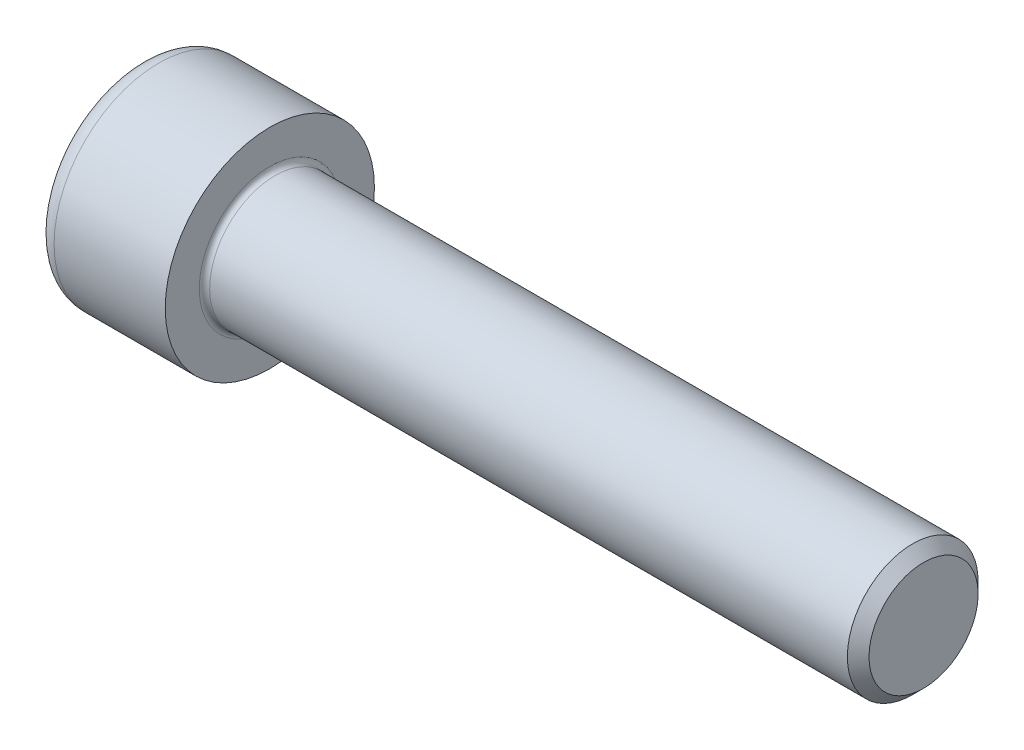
ISO-10303-21;
HEADER;
FILE_DESCRIPTION(('STEP AP214'),'2;1');
FILE_NAME('part.step','',(''),(''),'','','');
FILE_SCHEMA(('AUTOMOTIVE_DESIGN { 1 0 10303 214 1 1 1 1 }'));
ENDSEC;
DATA;
#1=APPLICATION_CONTEXT('core data for automotive mechanical design processes');
#2=APPLICATION_PROTOCOL_DEFINITION('international standard','automotive_design',2000,#1);
#3=PRODUCT_CONTEXT('',#1,'mechanical');
#4=PRODUCT('Part','Part','',(#3));
#5=PRODUCT_RELATED_PRODUCT_CATEGORY('part','',(#4));
#6=PRODUCT_DEFINITION_FORMATION('','',#4);
#7=PRODUCT_DEFINITION_CONTEXT('part definition',#1,'design');
#8=PRODUCT_DEFINITION('design','',#6,#7);
#9=PRODUCT_DEFINITION_SHAPE('','',#8);
#10=(LENGTH_UNIT() NAMED_UNIT(*) SI_UNIT(.MILLI.,.METRE.));
#11=(NAMED_UNIT(*) PLANE_ANGLE_UNIT() SI_UNIT($,.RADIAN.));
#12=(NAMED_UNIT(*) SI_UNIT($,.STERADIAN.) SOLID_ANGLE_UNIT());
#13=UNCERTAINTY_MEASURE_WITH_UNIT(LENGTH_MEASURE(1.E-05),#10,'distance_accuracy_value','');
#14=(GEOMETRIC_REPRESENTATION_CONTEXT(3) GLOBAL_UNCERTAINTY_ASSIGNED_CONTEXT((#13)) GLOBAL_UNIT_ASSIGNED_CONTEXT((#10,
#11,#12)) REPRESENTATION_CONTEXT('',''));
#15=CARTESIAN_POINT('',(0.,0.,0.));
#16=DIRECTION('',(0.,0.,1.));
#17=DIRECTION('',(1.,0.,0.));
#18=AXIS2_PLACEMENT_3D('',#15,#16,#17);
#19=CARTESIAN_POINT('',(0.,0.,0.));
#20=DIRECTION('',(-1.,0.,0.));
#21=DIRECTION('',(0.,0.,1.));
#22=AXIS2_PLACEMENT_3D('',#19,#20,#21);
#23=PLANE('',#22);
#24=DIRECTION('',(0.,-0.499999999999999,0.866025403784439));
#25=VECTOR('',#24,1.);
#26=CARTESIAN_POINT('',(0.,4.68519743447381,0.));
#27=LINE('',#26,#25);
#28=CARTESIAN_POINT('',(0.,4.68519743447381,0.));
#29=VERTEX_POINT('',#28);
#30=CARTESIAN_POINT('',(0.,2.34259871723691,4.0575));
#31=VERTEX_POINT('',#30);
#32=EDGE_CURVE('E257',#29,#31,#27,.T.);
#33=ORIENTED_EDGE('',*,*,#32,.T.);
#34=DIRECTION('',(0.,1.,0.));
#35=VECTOR('',#34,1.);
#36=CARTESIAN_POINT('',(0.,-2.34259871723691,4.0575));
#37=LINE('',#36,#35);
#38=CARTESIAN_POINT('',(0.,-2.34259871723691,4.0575));
#39=VERTEX_POINT('',#38);
#40=EDGE_CURVE('E129',#39,#31,#37,.T.);
#41=ORIENTED_EDGE('',*,*,#40,.F.);
#42=DIRECTION('',(0.,-0.500000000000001,-0.866025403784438));
#43=VECTOR('',#42,1.);
#44=CARTESIAN_POINT('',(0.,-2.34259871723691,4.0575));
#45=LINE('',#44,#43);
#46=CARTESIAN_POINT('',(0.,-4.68519743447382,0.));
#47=VERTEX_POINT('',#46);
#48=EDGE_CURVE('E260',#39,#47,#45,.T.);
#49=ORIENTED_EDGE('',*,*,#48,.T.);
#50=DIRECTION('',(0.,0.499999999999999,-0.866025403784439));
#51=VECTOR('',#50,1.);
#52=CARTESIAN_POINT('',(0.,-4.68519743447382,0.));
#53=LINE('',#52,#51);
#54=CARTESIAN_POINT('',(0.,-2.34259871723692,-4.0575));
#55=VERTEX_POINT('',#54);
#56=EDGE_CURVE('E263',#47,#55,#53,.T.);
#57=ORIENTED_EDGE('',*,*,#56,.T.);
#58=DIRECTION('',(0.,-1.,0.));
#59=VECTOR('',#58,1.);
#60=CARTESIAN_POINT('',(0.,2.3425987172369,-4.0575));
#61=LINE('',#60,#59);
#62=CARTESIAN_POINT('',(0.,2.3425987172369,-4.0575));
#63=VERTEX_POINT('',#62);
#64=EDGE_CURVE('E266',#63,#55,#61,.T.);
#65=ORIENTED_EDGE('',*,*,#64,.F.);
#66=DIRECTION('',(0.,-0.500000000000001,-0.866025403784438));
#67=VECTOR('',#66,1.);
#68=CARTESIAN_POINT('',(0.,4.68519743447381,0.));
#69=LINE('',#68,#67);
#70=EDGE_CURVE('E124',#29,#63,#69,.T.);
#71=ORIENTED_EDGE('',*,*,#70,.F.);
#72=EDGE_LOOP('',(#33,#41,#49,#57,#65,#71));
#73=FACE_BOUND('',#72,.T.);
#74=CARTESIAN_POINT('',(0.,0.,0.));
#75=DIRECTION('',(-1.,0.,0.));
#76=DIRECTION('',(0.,0.,1.));
#77=AXIS2_PLACEMENT_3D('',#74,#75,#76);
#78=CIRCLE('',#77,6.5);
#79=CARTESIAN_POINT('',(0.,0.,6.5));
#80=VERTEX_POINT('',#79);
#81=EDGE_CURVE('E41',#80,#80,#78,.T.);
#82=ORIENTED_EDGE('',*,*,#81,.T.);
#83=EDGE_LOOP('',(#82));
#84=FACE_BOUND('',#83,.T.);
#85=ADVANCED_FACE('F33',(#73,#84),#23,.T.);
#86=CARTESIAN_POINT('',(-31.75,0.,0.));
#87=DIRECTION('',(-1.,0.,0.));
#88=DIRECTION('',(0.,0.,1.));
#89=AXIS2_PLACEMENT_3D('',#86,#87,#88);
#90=CYLINDRICAL_SURFACE('',#89,8.);
#91=CARTESIAN_POINT('',(1.5,0.,0.));
#92=DIRECTION('',(-1.,0.,0.));
#93=DIRECTION('',(0.,0.,1.));
#94=AXIS2_PLACEMENT_3D('',#91,#92,#93);
#95=CIRCLE('',#94,8.);
#96=CARTESIAN_POINT('',(1.5,0.,8.));
#97=VERTEX_POINT('',#96);
#98=EDGE_CURVE('E11',#97,#97,#95,.F.);
#99=ORIENTED_EDGE('',*,*,#98,.T.);
#100=EDGE_LOOP('',(#99));
#101=FACE_BOUND('',#100,.T.);
#102=CARTESIAN_POINT('',(10.,0.,0.));
#103=DIRECTION('',(-1.,0.,0.));
#104=DIRECTION('',(0.,0.,1.));
#105=AXIS2_PLACEMENT_3D('',#102,#103,#104);
#106=CIRCLE('',#105,8.);
#107=CARTESIAN_POINT('',(10.,0.,8.));
#108=VERTEX_POINT('',#107);
#109=EDGE_CURVE('E147',#108,#108,#106,.T.);
#110=ORIENTED_EDGE('',*,*,#109,.T.);
#111=EDGE_LOOP('',(#110));
#112=FACE_BOUND('',#111,.T.);
#113=ADVANCED_FACE('F171',(#101,#112),#90,.T.);
#114=CARTESIAN_POINT('',(10.,8.,0.));
#115=DIRECTION('',(1.,0.,0.));
#116=DIRECTION('',(0.,0.,-1.));
#117=AXIS2_PLACEMENT_3D('',#114,#115,#116);
#118=PLANE('',#117);
#119=CARTESIAN_POINT('',(10.,0.,0.));
#120=DIRECTION('',(1.,0.,0.));
#121=DIRECTION('',(0.,0.,-1.));
#122=AXIS2_PLACEMENT_3D('',#119,#120,#121);
#123=CIRCLE('',#122,5.39999999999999);
#124=CARTESIAN_POINT('',(10.,0.,-5.39999999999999));
#125=VERTEX_POINT('',#124);
#126=EDGE_CURVE('E150',#125,#125,#123,.F.);
#127=ORIENTED_EDGE('',*,*,#126,.T.);
#128=EDGE_LOOP('',(#127));
#129=FACE_BOUND('',#128,.T.);
#130=ORIENTED_EDGE('',*,*,#109,.F.);
#131=EDGE_LOOP('',(#130));
#132=FACE_BOUND('',#131,.T.);
#133=ADVANCED_FACE('F177',(#129,#132),#118,.T.);
#134=CARTESIAN_POINT('',(-31.75,0.,0.));
#135=DIRECTION('',(-1.,0.,0.));
#136=DIRECTION('',(0.,0.,1.));
#137=AXIS2_PLACEMENT_3D('',#134,#135,#136);
#138=CYLINDRICAL_SURFACE('',#137,4.99999999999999);
#139=CARTESIAN_POINT('',(10.4,0.,0.));
#140=DIRECTION('',(1.,0.,0.));
#141=DIRECTION('',(0.,0.,-1.));
#142=AXIS2_PLACEMENT_3D('',#139,#140,#141);
#143=CIRCLE('',#142,4.99999999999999);
#144=CARTESIAN_POINT('',(10.4,0.,-4.99999999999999));
#145=VERTEX_POINT('',#144);
#146=EDGE_CURVE('E153',#145,#145,#143,.T.);
#147=ORIENTED_EDGE('',*,*,#146,.T.);
#148=EDGE_LOOP('',(#147));
#149=FACE_BOUND('',#148,.T.);
#150=CARTESIAN_POINT('',(59.172,0.,0.));
#151=DIRECTION('',(-1.,0.,0.));
#152=DIRECTION('',(0.,0.,1.));
#153=AXIS2_PLACEMENT_3D('',#150,#151,#152);
#154=CIRCLE('',#153,4.99999999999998);
#155=CARTESIAN_POINT('',(59.172,0.,4.99999999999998));
#156=VERTEX_POINT('',#155);
#157=EDGE_CURVE('E144',#156,#156,#154,.T.);
#158=ORIENTED_EDGE('',*,*,#157,.T.);
#159=EDGE_LOOP('',(#158));
#160=FACE_BOUND('',#159,.T.);
#161=ADVANCED_FACE('F183',(#149,#160),#138,.T.);
#162=CARTESIAN_POINT('',(60.,0.,0.));
#163=DIRECTION('',(-1.,0.,0.));
#164=DIRECTION('',(0.,0.,1.));
#165=AXIS2_PLACEMENT_3D('',#162,#163,#164);
#166=CONICAL_SURFACE('',#165,4.172,0.78539816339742);
#167=ORIENTED_EDGE('',*,*,#157,.F.);
#168=EDGE_LOOP('',(#167));
#169=FACE_BOUND('',#168,.T.);
#170=CARTESIAN_POINT('',(60.,0.,0.));
#171=DIRECTION('',(-1.,0.,0.));
#172=DIRECTION('',(0.,0.,1.));
#173=AXIS2_PLACEMENT_3D('',#170,#171,#172);
#174=CIRCLE('',#173,4.172);
#175=CARTESIAN_POINT('',(60.,0.,4.172));
#176=VERTEX_POINT('',#175);
#177=EDGE_CURVE('E140',#176,#176,#174,.T.);
#178=ORIENTED_EDGE('',*,*,#177,.T.);
#179=EDGE_LOOP('',(#178));
#180=FACE_BOUND('',#179,.T.);
#181=ADVANCED_FACE('F187',(#169,#180),#166,.T.);
#182=CARTESIAN_POINT('',(60.,4.172,0.));
#183=DIRECTION('',(1.,0.,0.));
#184=DIRECTION('',(0.,0.,-1.));
#185=AXIS2_PLACEMENT_3D('',#182,#183,#184);
#186=PLANE('',#185);
#187=ORIENTED_EDGE('',*,*,#177,.F.);
#188=EDGE_LOOP('',(#187));
#189=FACE_BOUND('',#188,.T.);
#190=ADVANCED_FACE('F167',(#189),#186,.T.);
#191=CARTESIAN_POINT('',(10.4,0.,0.));
#192=DIRECTION('',(1.,0.,0.));
#193=DIRECTION('',(0.,0.,-1.));
#194=AXIS2_PLACEMENT_3D('',#191,#192,#193);
#195=TOROIDAL_SURFACE('',#194,5.39999999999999,0.4);
#196=ORIENTED_EDGE('',*,*,#146,.F.);
#197=EDGE_LOOP('',(#196));
#198=FACE_BOUND('',#197,.T.);
#199=ORIENTED_EDGE('',*,*,#126,.F.);
#200=EDGE_LOOP('',(#199));
#201=FACE_BOUND('',#200,.T.);
#202=ADVANCED_FACE('F160',(#198,#201),#195,.F.);
#203=CARTESIAN_POINT('',(1.5,0.,0.));
#204=DIRECTION('',(-1.,0.,0.));
#205=DIRECTION('',(0.,0.,1.));
#206=AXIS2_PLACEMENT_3D('',#203,#204,#205);
#207=TOROIDAL_SURFACE('',#206,6.5,1.5);
#208=ORIENTED_EDGE('',*,*,#98,.F.);
#209=EDGE_LOOP('',(#208));
#210=FACE_BOUND('',#209,.T.);
#211=ORIENTED_EDGE('',*,*,#81,.F.);
#212=EDGE_LOOP('',(#211));
#213=FACE_BOUND('',#212,.T.);
#214=ADVANCED_FACE('F35',(#210,#213),#207,.T.);
#215=CARTESIAN_POINT('',(5.,4.68519743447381,0.));
#216=DIRECTION('',(0.,-0.866025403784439,-0.499999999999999));
#217=DIRECTION('',(0.,0.499999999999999,-0.866025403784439));
#218=AXIS2_PLACEMENT_3D('',#215,#216,#217);
#219=PLANE('',#218);
#220=ORIENTED_EDGE('',*,*,#32,.F.);
#221=DIRECTION('',(-1.,0.,0.));
#222=VECTOR('',#221,1.);
#223=CARTESIAN_POINT('',(5.,4.68519743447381,0.));
#224=LINE('',#223,#222);
#225=CARTESIAN_POINT('',(5.,4.68519743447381,0.));
#226=VERTEX_POINT('',#225);
#227=EDGE_CURVE('E247',#226,#29,#224,.T.);
#228=ORIENTED_EDGE('',*,*,#227,.F.);
#229=DIRECTION('',(0.,-0.499999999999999,0.866025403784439));
#230=VECTOR('',#229,1.);
#231=CARTESIAN_POINT('',(5.,4.68519743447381,0.));
#232=LINE('',#231,#230);
#233=CARTESIAN_POINT('',(5.,3.51389807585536,2.02874999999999));
#234=VERTEX_POINT('',#233);
#235=EDGE_CURVE('E116',#226,#234,#232,.T.);
#236=ORIENTED_EDGE('',*,*,#235,.T.);
#237=CARTESIAN_POINT('',(5.,2.34259871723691,4.0575));
#238=VERTEX_POINT('',#237);
#239=EDGE_CURVE('E107',#234,#238,#232,.T.);
#240=ORIENTED_EDGE('',*,*,#239,.T.);
#241=DIRECTION('',(-1.,0.,0.));
#242=VECTOR('',#241,1.);
#243=CARTESIAN_POINT('',(5.,2.34259871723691,4.0575));
#244=LINE('',#243,#242);
#245=EDGE_CURVE('E121',#238,#31,#244,.T.);
#246=ORIENTED_EDGE('',*,*,#245,.T.);
#247=EDGE_LOOP('',(#220,#228,#236,#240,#246));
#248=FACE_BOUND('',#247,.T.);
#249=ADVANCED_FACE('F120',(#248),#219,.T.);
#250=CARTESIAN_POINT('',(5.,-2.34259871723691,4.0575));
#251=DIRECTION('',(0.,0.,1.));
#252=DIRECTION('',(0.,-1.,0.));
#253=AXIS2_PLACEMENT_3D('',#250,#251,#252);
#254=PLANE('',#253);
#255=ORIENTED_EDGE('',*,*,#40,.T.);
#256=ORIENTED_EDGE('',*,*,#245,.F.);
#257=DIRECTION('',(0.,1.,0.));
#258=VECTOR('',#257,1.);
#259=CARTESIAN_POINT('',(5.,-2.34259871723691,4.0575));
#260=LINE('',#259,#258);
#261=CARTESIAN_POINT('',(5.,0.,4.0575));
#262=VERTEX_POINT('',#261);
#263=EDGE_CURVE('E104',#262,#238,#260,.T.);
#264=ORIENTED_EDGE('',*,*,#263,.F.);
#265=CARTESIAN_POINT('',(5.,-2.34259871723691,4.0575));
#266=VERTEX_POINT('',#265);
#267=EDGE_CURVE('E115',#266,#262,#260,.T.);
#268=ORIENTED_EDGE('',*,*,#267,.F.);
#269=DIRECTION('',(-1.,0.,0.));
#270=VECTOR('',#269,1.);
#271=CARTESIAN_POINT('',(5.,-2.34259871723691,4.0575));
#272=LINE('',#271,#270);
#273=EDGE_CURVE('E131',#266,#39,#272,.T.);
#274=ORIENTED_EDGE('',*,*,#273,.T.);
#275=EDGE_LOOP('',(#255,#256,#264,#268,#274));
#276=FACE_BOUND('',#275,.T.);
#277=ADVANCED_FACE('F126',(#276),#254,.F.);
#278=CARTESIAN_POINT('',(5.,-2.34259871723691,4.0575));
#279=DIRECTION('',(0.,0.866025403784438,-0.500000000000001));
#280=DIRECTION('',(0.,0.500000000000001,0.866025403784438));
#281=AXIS2_PLACEMENT_3D('',#278,#279,#280);
#282=PLANE('',#281);
#283=ORIENTED_EDGE('',*,*,#48,.F.);
#284=ORIENTED_EDGE('',*,*,#273,.F.);
#285=DIRECTION('',(0.,-0.500000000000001,-0.866025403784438));
#286=VECTOR('',#285,1.);
#287=CARTESIAN_POINT('',(5.,-2.34259871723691,4.0575));
#288=LINE('',#287,#286);
#289=CARTESIAN_POINT('',(5.,-3.51389807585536,2.02875000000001));
#290=VERTEX_POINT('',#289);
#291=EDGE_CURVE('E286',#266,#290,#288,.T.);
#292=ORIENTED_EDGE('',*,*,#291,.T.);
#293=CARTESIAN_POINT('',(5.,-4.68519743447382,0.));
#294=VERTEX_POINT('',#293);
#295=EDGE_CURVE('E275',#290,#294,#288,.T.);
#296=ORIENTED_EDGE('',*,*,#295,.T.);
#297=DIRECTION('',(-1.,0.,0.));
#298=VECTOR('',#297,1.);
#299=CARTESIAN_POINT('',(5.,-4.68519743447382,0.));
#300=LINE('',#299,#298);
#301=EDGE_CURVE('E136',#294,#47,#300,.T.);
#302=ORIENTED_EDGE('',*,*,#301,.T.);
#303=EDGE_LOOP('',(#283,#284,#292,#296,#302));
#304=FACE_BOUND('',#303,.T.);
#305=ADVANCED_FACE('F201',(#304),#282,.T.);
#306=CARTESIAN_POINT('',(5.,-4.68519743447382,0.));
#307=DIRECTION('',(0.,0.866025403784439,0.499999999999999));
#308=DIRECTION('',(0.,-0.499999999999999,0.866025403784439));
#309=AXIS2_PLACEMENT_3D('',#306,#307,#308);
#310=PLANE('',#309);
#311=ORIENTED_EDGE('',*,*,#56,.F.);
#312=ORIENTED_EDGE('',*,*,#301,.F.);
#313=DIRECTION('',(0.,0.499999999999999,-0.866025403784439));
#314=VECTOR('',#313,1.);
#315=CARTESIAN_POINT('',(5.,-4.68519743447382,0.));
#316=LINE('',#315,#314);
#317=CARTESIAN_POINT('',(5.,-3.51389807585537,-2.02875));
#318=VERTEX_POINT('',#317);
#319=EDGE_CURVE('E253',#294,#318,#316,.T.);
#320=ORIENTED_EDGE('',*,*,#319,.T.);
#321=CARTESIAN_POINT('',(5.,-2.34259871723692,-4.0575));
#322=VERTEX_POINT('',#321);
#323=EDGE_CURVE('E285',#318,#322,#316,.T.);
#324=ORIENTED_EDGE('',*,*,#323,.T.);
#325=DIRECTION('',(-1.,0.,0.));
#326=VECTOR('',#325,1.);
#327=CARTESIAN_POINT('',(5.,-2.34259871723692,-4.0575));
#328=LINE('',#327,#326);
#329=EDGE_CURVE('E246',#322,#55,#328,.T.);
#330=ORIENTED_EDGE('',*,*,#329,.T.);
#331=EDGE_LOOP('',(#311,#312,#320,#324,#330));
#332=FACE_BOUND('',#331,.T.);
#333=ADVANCED_FACE('F204',(#332),#310,.T.);
#334=CARTESIAN_POINT('',(5.,2.3425987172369,-4.0575));
#335=DIRECTION('',(0.,0.,-1.));
#336=DIRECTION('',(0.,1.,0.));
#337=AXIS2_PLACEMENT_3D('',#334,#335,#336);
#338=PLANE('',#337);
#339=ORIENTED_EDGE('',*,*,#64,.T.);
#340=ORIENTED_EDGE('',*,*,#329,.F.);
#341=DIRECTION('',(0.,-1.,0.));
#342=VECTOR('',#341,1.);
#343=CARTESIAN_POINT('',(5.,2.3425987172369,-4.0575));
#344=LINE('',#343,#342);
#345=CARTESIAN_POINT('',(5.,0.,-4.0575));
#346=VERTEX_POINT('',#345);
#347=EDGE_CURVE('E250',#346,#322,#344,.T.);
#348=ORIENTED_EDGE('',*,*,#347,.F.);
#349=CARTESIAN_POINT('',(5.,2.3425987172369,-4.0575));
#350=VERTEX_POINT('',#349);
#351=EDGE_CURVE('E48',#350,#346,#344,.T.);
#352=ORIENTED_EDGE('',*,*,#351,.F.);
#353=DIRECTION('',(-1.,0.,0.));
#354=VECTOR('',#353,1.);
#355=CARTESIAN_POINT('',(5.,2.3425987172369,-4.0575));
#356=LINE('',#355,#354);
#357=EDGE_CURVE('E243',#350,#63,#356,.T.);
#358=ORIENTED_EDGE('',*,*,#357,.T.);
#359=EDGE_LOOP('',(#339,#340,#348,#352,#358));
#360=FACE_BOUND('',#359,.T.);
#361=ADVANCED_FACE('F208',(#360),#338,.F.);
#362=CARTESIAN_POINT('',(5.,4.68519743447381,0.));
#363=DIRECTION('',(0.,0.866025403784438,-0.500000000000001));
#364=DIRECTION('',(0.,0.500000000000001,0.866025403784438));
#365=AXIS2_PLACEMENT_3D('',#362,#363,#364);
#366=PLANE('',#365);
#367=ORIENTED_EDGE('',*,*,#70,.T.);
#368=ORIENTED_EDGE('',*,*,#357,.F.);
#369=DIRECTION('',(0.,-0.500000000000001,-0.866025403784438));
#370=VECTOR('',#369,1.);
#371=CARTESIAN_POINT('',(5.,4.68519743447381,0.));
#372=LINE('',#371,#370);
#373=CARTESIAN_POINT('',(5.,3.51389807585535,-2.02875));
#374=VERTEX_POINT('',#373);
#375=EDGE_CURVE('E233',#374,#350,#372,.T.);
#376=ORIENTED_EDGE('',*,*,#375,.F.);
#377=EDGE_CURVE('E239',#226,#374,#372,.T.);
#378=ORIENTED_EDGE('',*,*,#377,.F.);
#379=ORIENTED_EDGE('',*,*,#227,.T.);
#380=EDGE_LOOP('',(#367,#368,#376,#378,#379));
#381=FACE_BOUND('',#380,.T.);
#382=ADVANCED_FACE('F212',(#381),#366,.F.);
#383=CARTESIAN_POINT('',(5.,4.68519743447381,0.));
#384=DIRECTION('',(1.,0.,0.));
#385=DIRECTION('',(0.,0.,-1.));
#386=AXIS2_PLACEMENT_3D('',#383,#384,#385);
#387=PLANE('',#386);
#388=ORIENTED_EDGE('',*,*,#347,.T.);
#389=ORIENTED_EDGE('',*,*,#323,.F.);
#390=CARTESIAN_POINT('',(5.,0.,0.));
#391=DIRECTION('',(-1.,0.,0.));
#392=DIRECTION('',(0.,0.,1.));
#393=AXIS2_PLACEMENT_3D('',#390,#391,#392);
#394=CIRCLE('',#393,4.0575);
#395=EDGE_CURVE('E281',#346,#318,#394,.T.);
#396=ORIENTED_EDGE('',*,*,#395,.F.);
#397=EDGE_LOOP('',(#388,#389,#396));
#398=FACE_BOUND('',#397,.T.);
#399=ADVANCED_FACE('F216',(#398),#387,.F.);
#400=ORIENTED_EDGE('',*,*,#319,.F.);
#401=ORIENTED_EDGE('',*,*,#295,.F.);
#402=EDGE_CURVE('E134',#318,#290,#394,.T.);
#403=ORIENTED_EDGE('',*,*,#402,.F.);
#404=EDGE_LOOP('',(#400,#401,#403));
#405=FACE_BOUND('',#404,.T.);
#406=ADVANCED_FACE('F219',(#405),#387,.F.);
#407=ORIENTED_EDGE('',*,*,#291,.F.);
#408=ORIENTED_EDGE('',*,*,#267,.T.);
#409=EDGE_CURVE('E130',#290,#262,#394,.T.);
#410=ORIENTED_EDGE('',*,*,#409,.F.);
#411=EDGE_LOOP('',(#407,#408,#410));
#412=FACE_BOUND('',#411,.T.);
#413=ADVANCED_FACE('F224',(#412),#387,.F.);
#414=ORIENTED_EDGE('',*,*,#263,.T.);
#415=ORIENTED_EDGE('',*,*,#239,.F.);
#416=EDGE_CURVE('E110',#262,#234,#394,.T.);
#417=ORIENTED_EDGE('',*,*,#416,.F.);
#418=EDGE_LOOP('',(#414,#415,#417));
#419=FACE_BOUND('',#418,.T.);
#420=ADVANCED_FACE('F106',(#419),#387,.F.);
#421=ORIENTED_EDGE('',*,*,#235,.F.);
#422=ORIENTED_EDGE('',*,*,#377,.T.);
#423=EDGE_CURVE('E141',#234,#374,#394,.T.);
#424=ORIENTED_EDGE('',*,*,#423,.F.);
#425=EDGE_LOOP('',(#421,#422,#424));
#426=FACE_BOUND('',#425,.T.);
#427=ADVANCED_FACE('F227',(#426),#387,.F.);
#428=ORIENTED_EDGE('',*,*,#375,.T.);
#429=ORIENTED_EDGE('',*,*,#351,.T.);
#430=EDGE_CURVE('E236',#374,#346,#394,.T.);
#431=ORIENTED_EDGE('',*,*,#430,.F.);
#432=EDGE_LOOP('',(#428,#429,#431));
#433=FACE_BOUND('',#432,.T.);
#434=ADVANCED_FACE('F197',(#433),#387,.F.);
#435=CARTESIAN_POINT('',(5.,0.,0.));
#436=DIRECTION('',(-1.,0.,0.));
#437=DIRECTION('',(0.,0.,1.));
#438=AXIS2_PLACEMENT_3D('',#435,#436,#437);
#439=CONICAL_SURFACE('',#438,4.0575,1.04719755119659);
#440=CARTESIAN_POINT('',(7.34259871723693,0.,0.));
#441=VERTEX_POINT('',#440);
#442=VERTEX_LOOP('',#441);
#443=FACE_BOUND('',#442,.T.);
#444=ORIENTED_EDGE('',*,*,#416,.T.);
#445=ORIENTED_EDGE('',*,*,#423,.T.);
#446=ORIENTED_EDGE('',*,*,#430,.T.);
#447=ORIENTED_EDGE('',*,*,#395,.T.);
#448=ORIENTED_EDGE('',*,*,#402,.T.);
#449=ORIENTED_EDGE('',*,*,#409,.T.);
#450=EDGE_LOOP('',(#444,#445,#446,#447,#448,#449));
#451=FACE_BOUND('',#450,.T.);
#452=ADVANCED_FACE('F195',(#443,#451),#439,.F.);
#453=CLOSED_SHELL('',(#85,#113,#133,#161,#181,#190,#202,#214,#249,#277,#305,#333,#361,#382,#399,
#406,#413,#420,#427,#434,#452));
#454=MANIFOLD_SOLID_BREP('B2',#453);
#455=ADVANCED_BREP_SHAPE_REPRESENTATION('',(#18,#454),#14);
#456=SHAPE_DEFINITION_REPRESENTATION(#9,#455);
ENDSEC;
END-ISO-10303-21;
